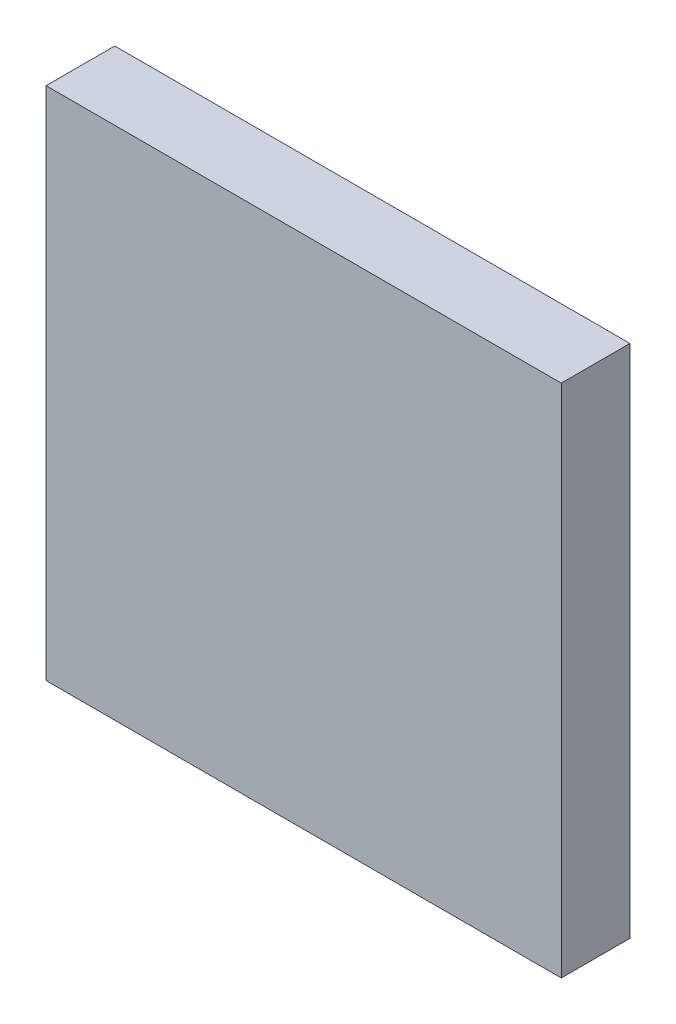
from build123d import *

# Parameters (mm, degrees)
SKETCH1_W           = 7.5
SKETCH1_H           = 7.5
BOSS_EXTRUDE1_DEPTH = 1


with BuildPart() as part:
    # Sketch1 → Boss-Extrude1 (new body)
    with BuildSketch(Plane.XY):
        with Locations((3.75, -3.75)):
            Rectangle(SKETCH1_W, SKETCH1_H)
    extrude(amount=BOSS_EXTRUDE1_DEPTH)


solid = part.part
